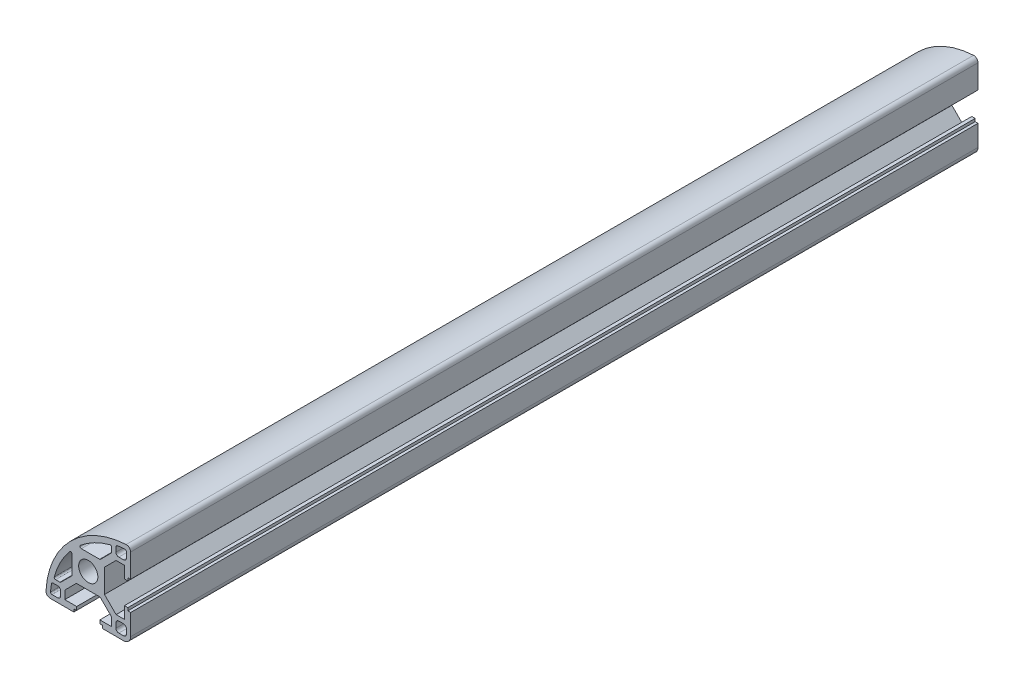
from build123d import *

# Parameters (mm, degrees)
EXTRUDE_1_DEPTH = 300


with BuildPart() as part:
    # Sketch 1 → Extrude 1 (new body)
    with BuildSketch(Plane.XY):
        with BuildLine():
            Line((5.100000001, -14.999999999), (12.499999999, -14.999999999))
            ThreePointArc((12.499999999, -14.999999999), (14.267766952, -14.267766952), (14.999999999, -12.499999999))
            Line((14.999999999, -12.499999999), (14.999999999, -5.100000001))
            Line((14.999999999, -5.100000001), (14, -5.100000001))
            Line((14, -5.100000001), (14, -4.099999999))
            Line((14, -4.099999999), (12.799999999, -4.099999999))
            Line((12.799999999, -4.099999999), (12.799999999, -8.3))
            Line((12.799999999, -8.3), (9.85563492, -8.3))
            Line((9.85563492, -8.3), (5.75, -4.19436508))
            Line((5.75, -4.19436508), (5.75, 0))
            Line((5.75, 0), (5.75, 4.19436508))
            Line((5.75, 4.19436508), (9.85563492, 8.3))
            Line((9.85563492, 8.3), (12.799999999, 8.3))
            Line((12.799999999, 8.3), (12.799999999, 4.099999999))
            Line((12.799999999, 4.099999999), (14, 4.099999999))
            Line((14, 4.099999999), (14, 5.100000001))
            Line((14, 5.100000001), (14.999999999, 5.100000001))
            Line((14.999999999, 5.100000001), (14.999999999, 13.460498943))
            ThreePointArc((14.999999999, 13.460498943), (14.532370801, 14.548713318), (13.42105263, 14.95841994))
            ThreePointArc((13.42105263, 14.95841994), (2.793844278, 12.404557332), (-6.213203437, 6.213203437))
            ThreePointArc((-6.213203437, 6.213203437), (-12.404557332, -2.793844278), (-14.95841994, -13.42105263))
            ThreePointArc((-14.95841994, -13.42105263), (-14.548713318, -14.532370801), (-13.460498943, -14.999999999))
            Line((-13.460498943, -14.999999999), (-5.100000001, -14.999999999))
            Line((-5.100000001, -14.999999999), (-5.100000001, -14))
            Line((-5.100000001, -14), (-4.099999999, -14))
            Line((-4.099999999, -14), (-4.099999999, -12.799999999))
            Line((-4.099999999, -12.799999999), (-8.3, -12.799999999))
            Line((-8.3, -12.799999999), (-8.3, -9.85563492))
            Line((-8.3, -9.85563492), (-4.19436508, -5.75))
            Line((-4.19436508, -5.75), (0, -5.75))
            Line((0, -5.75), (4.19436508, -5.75))
            Line((4.19436508, -5.75), (8.3, -9.85563492))
            Line((8.3, -9.85563492), (8.3, -12.799999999))
            Line((8.3, -12.799999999), (4.099999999, -12.799999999))
            Line((4.099999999, -12.799999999), (4.099999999, -14))
            Line((4.099999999, -14), (5.100000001, -14))
            Line((5.100000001, -14), (5.100000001, -14.999999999))
        make_face()
        with BuildLine():
            Line((9.8, -10.8), (9.8, -12.499999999))
            ThreePointArc((9.8, -12.499999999), (10.092893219, -13.20710678), (10.8, -13.499999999))
            Line((10.8, -13.499999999), (12.499999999, -13.499999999))
            ThreePointArc((12.499999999, -13.499999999), (13.20710678, -13.20710678), (13.499999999, -12.499999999))
            Line((13.499999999, -12.499999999), (13.499999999, -10.8))
            ThreePointArc((13.499999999, -10.8), (13.20710678, -10.092893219), (12.499999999, -9.8))
            Line((12.499999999, -9.8), (10.8, -9.8))
            ThreePointArc((10.8, -9.8), (10.092893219, -10.092893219), (9.8, -10.8))
        make_face(mode=Mode.SUBTRACT)
        with BuildLine():
            Line((-2.455300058, 5.75), (0, 5.75))
            Line((0, 5.75), (3.987258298, 5.75))
            ThreePointArc((3.987258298, 5.75), (4.178600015, 5.788060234), (4.340811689, 5.896446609))
            Line((4.340811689, 5.896446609), (8.153553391, 9.709188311))
            ThreePointArc((8.153553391, 9.709188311), (8.261939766, 9.871399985), (8.3, 10.062741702))
            Line((8.3, 10.062741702), (8.3, 11.540723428))
            ThreePointArc((8.3, 11.540723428), (8.103764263, 11.937872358), (7.669090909, 12.023282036))
            ThreePointArc((7.669090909, 12.023282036), (2.162471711, 9.883686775), (-2.77266915, 6.636363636))
            ThreePointArc((-2.77266915, 6.636363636), (-2.926034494, 6.081450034), (-2.455300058, 5.75))
        make_face(mode=Mode.SUBTRACT)
        with BuildLine():
            Line((9.8, 12.513642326), (9.8, 10.8))
            ThreePointArc((9.8, 10.8), (10.092893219, 10.092893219), (10.8, 9.8))
            Line((10.8, 9.8), (12.499999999, 9.8))
            ThreePointArc((12.499999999, 9.8), (13.20710678, 10.092893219), (13.499999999, 10.8))
            Line((13.499999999, 10.8), (13.499999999, 12.845431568))
            ThreePointArc((13.499999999, 12.845431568), (13.340454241, 13.211615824), (12.963636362, 13.344107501))
            ThreePointArc((12.963636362, 13.344107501), (11.58491117, 13.209210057), (10.214545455, 13.006285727))
            ThreePointArc((10.214545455, 13.006285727), (9.917424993, 12.835568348), (9.8, 12.513642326))
        make_face(mode=Mode.SUBTRACT)
        with BuildLine():
            Line((-11.540723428, -8.3), (-10.062741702, -8.3))
            ThreePointArc((-10.062741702, -8.3), (-9.871399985, -8.261939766), (-9.709188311, -8.153553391))
            Line((-9.709188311, -8.153553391), (-5.896446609, -4.340811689))
            ThreePointArc((-5.896446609, -4.340811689), (-5.788060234, -4.178600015), (-5.75, -3.987258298))
            Line((-5.75, -3.987258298), (-5.75, 0))
            Line((-5.75, 0), (-5.75, 2.455300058))
            ThreePointArc((-5.75, 2.455300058), (-6.081450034, 2.926034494), (-6.636363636, 2.77266915))
            ThreePointArc((-6.636363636, 2.77266915), (-9.883686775, -2.162471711), (-12.023282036, -7.669090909))
            ThreePointArc((-12.023282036, -7.669090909), (-11.937872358, -8.103764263), (-11.540723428, -8.3))
        make_face(mode=Mode.SUBTRACT)
        with BuildLine():
            Line((-12.845431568, -13.499999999), (-10.8, -13.499999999))
            ThreePointArc((-10.8, -13.499999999), (-10.092893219, -13.20710678), (-9.8, -12.499999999))
            Line((-9.8, -12.499999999), (-9.8, -10.8))
            ThreePointArc((-9.8, -10.8), (-10.092893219, -10.092893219), (-10.8, -9.8))
            Line((-10.8, -9.8), (-12.513642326, -9.8))
            ThreePointArc((-12.513642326, -9.8), (-12.835568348, -9.917424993), (-13.006285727, -10.214545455))
            ThreePointArc((-13.006285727, -10.214545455), (-13.209210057, -11.58491117), (-13.344107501, -12.963636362))
            ThreePointArc((-13.344107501, -12.963636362), (-13.211615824, -13.340454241), (-12.845431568, -13.499999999))
        make_face(mode=Mode.SUBTRACT)
        with BuildLine():
            ThreePointArc((0, 3.4), (-2.404163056, 2.404163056), (-3.4, 0))
            ThreePointArc((-3.4, 0), (-2.404163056, -2.404163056), (0, -3.4))
            ThreePointArc((0, -3.4), (2.404163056, -2.404163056), (3.4, 0))
            ThreePointArc((3.4, 0), (2.404163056, 2.404163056), (0, 3.4))
        make_face(mode=Mode.SUBTRACT)
    extrude(amount=EXTRUDE_1_DEPTH)


solid = part.part
